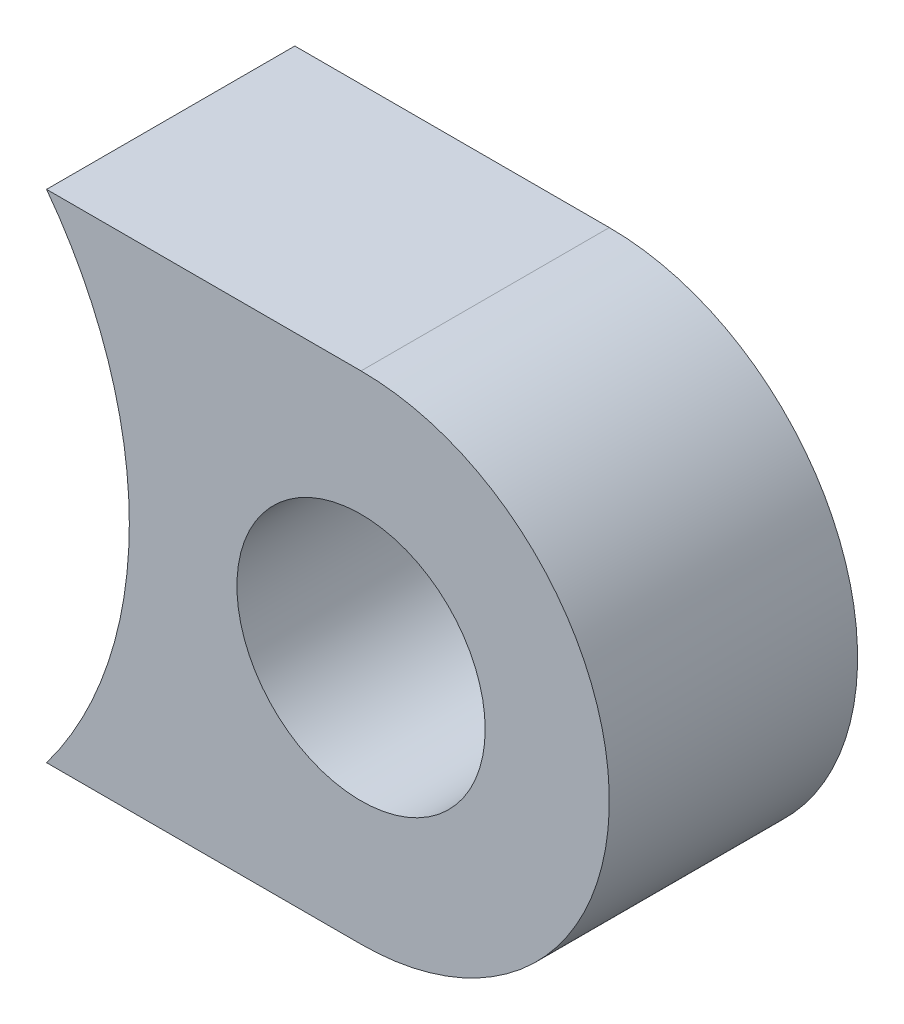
from build123d import *

# Parameters (mm, degrees)
SKETCH_1_R      = 15
EXTRUDE_1_DEPTH = 30


with BuildPart() as part:
    # Sketch 1 → Extrude 1 (new body)
    with BuildSketch(Plane.XY):
        with BuildLine():
            Line((78, 30), (40, 30))
            ThreePointArc((40, 30), (47.434164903, 15.811388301), (50, 0))
            ThreePointArc((50, 0), (47.434164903, -15.811388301), (40, -30))
            Line((40, -30), (78, -30))
            ThreePointArc((78, -30), (108, 0), (78, 30))
        make_face()
        with Locations((78, 0)):
            Circle(SKETCH_1_R, mode=Mode.SUBTRACT)
    extrude(amount=EXTRUDE_1_DEPTH)


solid = part.part
